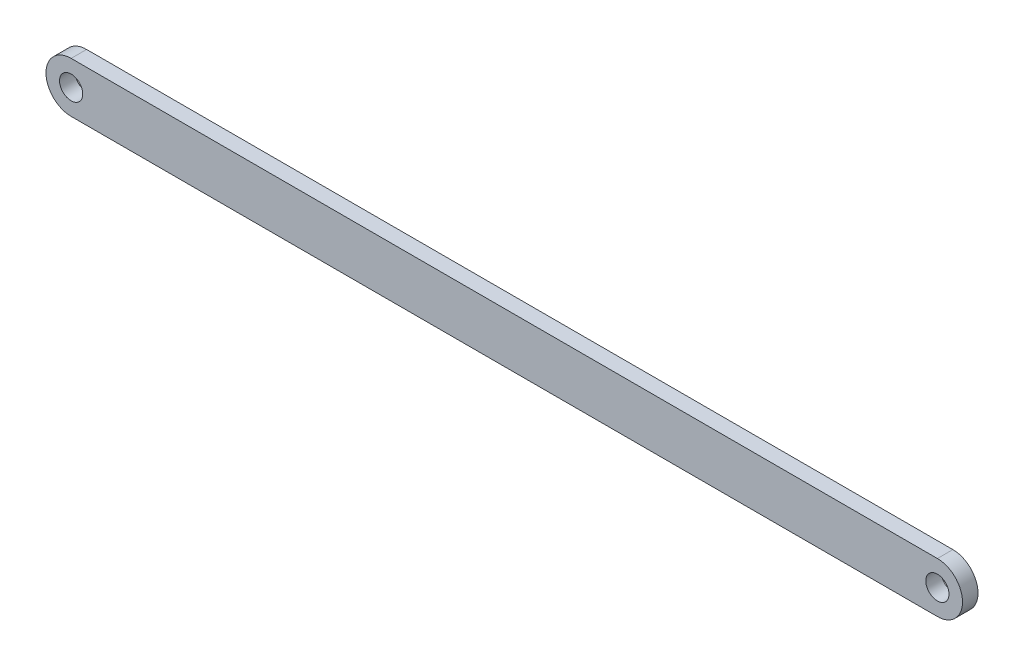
ISO-10303-21;
HEADER;
FILE_DESCRIPTION(('STEP AP214'),'2;1');
FILE_NAME('part.step','',(''),(''),'','','');
FILE_SCHEMA(('AUTOMOTIVE_DESIGN { 1 0 10303 214 1 1 1 1 }'));
ENDSEC;
DATA;
#1=APPLICATION_CONTEXT('core data for automotive mechanical design processes');
#2=APPLICATION_PROTOCOL_DEFINITION('international standard','automotive_design',2000,#1);
#3=PRODUCT_CONTEXT('',#1,'mechanical');
#4=PRODUCT('Part','Part','',(#3));
#5=PRODUCT_RELATED_PRODUCT_CATEGORY('part','',(#4));
#6=PRODUCT_DEFINITION_FORMATION('','',#4);
#7=PRODUCT_DEFINITION_CONTEXT('part definition',#1,'design');
#8=PRODUCT_DEFINITION('design','',#6,#7);
#9=PRODUCT_DEFINITION_SHAPE('','',#8);
#10=(LENGTH_UNIT() NAMED_UNIT(*) SI_UNIT(.MILLI.,.METRE.));
#11=(NAMED_UNIT(*) PLANE_ANGLE_UNIT() SI_UNIT($,.RADIAN.));
#12=(NAMED_UNIT(*) SI_UNIT($,.STERADIAN.) SOLID_ANGLE_UNIT());
#13=UNCERTAINTY_MEASURE_WITH_UNIT(LENGTH_MEASURE(1.E-05),#10,'distance_accuracy_value','');
#14=(GEOMETRIC_REPRESENTATION_CONTEXT(3) GLOBAL_UNCERTAINTY_ASSIGNED_CONTEXT((#13)) GLOBAL_UNIT_ASSIGNED_CONTEXT((#10,
#11,#12)) REPRESENTATION_CONTEXT('',''));
#15=CARTESIAN_POINT('',(0.,0.,0.));
#16=DIRECTION('',(0.,0.,1.));
#17=DIRECTION('',(1.,0.,0.));
#18=AXIS2_PLACEMENT_3D('',#15,#16,#17);
#19=CARTESIAN_POINT('',(0.,0.,12.7));
#20=DIRECTION('',(0.,0.,-1.));
#21=DIRECTION('',(-1.,0.,0.));
#22=AXIS2_PLACEMENT_3D('',#19,#20,#21);
#23=PLANE('',#22);
#24=CARTESIAN_POINT('',(0.,0.,12.7));
#25=DIRECTION('',(0.,0.,1.));
#26=DIRECTION('',(1.,0.,0.));
#27=AXIS2_PLACEMENT_3D('',#24,#25,#26);
#28=CIRCLE('',#27,9.525);
#29=CARTESIAN_POINT('',(9.525,0.,12.7));
#30=VERTEX_POINT('',#29);
#31=EDGE_CURVE('E98',#30,#30,#28,.T.);
#32=ORIENTED_EDGE('',*,*,#31,.F.);
#33=EDGE_LOOP('',(#32));
#34=FACE_BOUND('',#33,.T.);
#35=CARTESIAN_POINT('',(0.,0.,12.7));
#36=DIRECTION('',(0.,0.,1.));
#37=DIRECTION('',(-1.,0.,0.));
#38=AXIS2_PLACEMENT_3D('',#35,#36,#37);
#39=CIRCLE('',#38,20.6375);
#40=CARTESIAN_POINT('',(0.,20.6375,12.7));
#41=VERTEX_POINT('',#40);
#42=CARTESIAN_POINT('',(0.,-20.6375000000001,12.7));
#43=VERTEX_POINT('',#42);
#44=EDGE_CURVE('E83',#41,#43,#39,.T.);
#45=ORIENTED_EDGE('',*,*,#44,.T.);
#46=DIRECTION('',(1.,0.,0.));
#47=VECTOR('',#46,1.);
#48=CARTESIAN_POINT('',(711.2,-20.6375,12.7));
#49=LINE('',#48,#47);
#50=CARTESIAN_POINT('',(711.2,-20.6375,12.7));
#51=VERTEX_POINT('',#50);
#52=EDGE_CURVE('E78',#43,#51,#49,.T.);
#53=ORIENTED_EDGE('',*,*,#52,.T.);
#54=CARTESIAN_POINT('',(711.2,0.,12.7));
#55=DIRECTION('',(0.,0.,1.));
#56=DIRECTION('',(-1.,0.,0.));
#57=AXIS2_PLACEMENT_3D('',#54,#55,#56);
#58=CIRCLE('',#57,20.6375);
#59=CARTESIAN_POINT('',(711.2,20.6375,12.7));
#60=VERTEX_POINT('',#59);
#61=EDGE_CURVE('E81',#51,#60,#58,.T.);
#62=ORIENTED_EDGE('',*,*,#61,.T.);
#63=DIRECTION('',(-1.,0.,0.));
#64=VECTOR('',#63,1.);
#65=CARTESIAN_POINT('',(0.,20.6375,12.7));
#66=LINE('',#65,#64);
#67=EDGE_CURVE('E48',#60,#41,#66,.T.);
#68=ORIENTED_EDGE('',*,*,#67,.T.);
#69=EDGE_LOOP('',(#45,#53,#62,#68));
#70=FACE_BOUND('',#69,.T.);
#71=CARTESIAN_POINT('',(711.2,0.,12.7));
#72=DIRECTION('',(0.,0.,1.));
#73=DIRECTION('',(1.,0.,0.));
#74=AXIS2_PLACEMENT_3D('',#71,#72,#73);
#75=CIRCLE('',#74,9.52500000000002);
#76=CARTESIAN_POINT('',(720.725,0.,12.7));
#77=VERTEX_POINT('',#76);
#78=EDGE_CURVE('E113',#77,#77,#75,.T.);
#79=ORIENTED_EDGE('',*,*,#78,.F.);
#80=EDGE_LOOP('',(#79));
#81=FACE_BOUND('',#80,.T.);
#82=ADVANCED_FACE('F31',(#34,#70,#81),#23,.F.);
#83=CARTESIAN_POINT('',(0.,0.,0.));
#84=DIRECTION('',(0.,0.,-1.));
#85=DIRECTION('',(-1.,0.,0.));
#86=AXIS2_PLACEMENT_3D('',#83,#84,#85);
#87=PLANE('',#86);
#88=CARTESIAN_POINT('',(0.,0.,0.));
#89=DIRECTION('',(0.,0.,1.));
#90=DIRECTION('',(1.,0.,0.));
#91=AXIS2_PLACEMENT_3D('',#88,#89,#90);
#92=CIRCLE('',#91,9.525);
#93=CARTESIAN_POINT('',(9.525,0.,0.));
#94=VERTEX_POINT('',#93);
#95=EDGE_CURVE('E110',#94,#94,#92,.T.);
#96=ORIENTED_EDGE('',*,*,#95,.T.);
#97=EDGE_LOOP('',(#96));
#98=FACE_BOUND('',#97,.T.);
#99=CARTESIAN_POINT('',(0.,0.,0.));
#100=DIRECTION('',(0.,0.,1.));
#101=DIRECTION('',(-1.,0.,0.));
#102=AXIS2_PLACEMENT_3D('',#99,#100,#101);
#103=CIRCLE('',#102,20.6375);
#104=CARTESIAN_POINT('',(0.,20.6375,0.));
#105=VERTEX_POINT('',#104);
#106=CARTESIAN_POINT('',(0.,-20.6375000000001,0.));
#107=VERTEX_POINT('',#106);
#108=EDGE_CURVE('E95',#105,#107,#103,.T.);
#109=ORIENTED_EDGE('',*,*,#108,.F.);
#110=DIRECTION('',(-1.,0.,0.));
#111=VECTOR('',#110,1.);
#112=CARTESIAN_POINT('',(0.,20.6375,0.));
#113=LINE('',#112,#111);
#114=CARTESIAN_POINT('',(711.2,20.6375,0.));
#115=VERTEX_POINT('',#114);
#116=EDGE_CURVE('E71',#115,#105,#113,.T.);
#117=ORIENTED_EDGE('',*,*,#116,.F.);
#118=CARTESIAN_POINT('',(711.2,0.,0.));
#119=DIRECTION('',(0.,0.,1.));
#120=DIRECTION('',(-1.,0.,0.));
#121=AXIS2_PLACEMENT_3D('',#118,#119,#120);
#122=CIRCLE('',#121,20.6375);
#123=CARTESIAN_POINT('',(711.2,-20.6375,0.));
#124=VERTEX_POINT('',#123);
#125=EDGE_CURVE('E65',#124,#115,#122,.T.);
#126=ORIENTED_EDGE('',*,*,#125,.F.);
#127=DIRECTION('',(1.,0.,0.));
#128=VECTOR('',#127,1.);
#129=CARTESIAN_POINT('',(711.2,-20.6375,0.));
#130=LINE('',#129,#128);
#131=EDGE_CURVE('E87',#107,#124,#130,.T.);
#132=ORIENTED_EDGE('',*,*,#131,.F.);
#133=EDGE_LOOP('',(#109,#117,#126,#132));
#134=FACE_BOUND('',#133,.T.);
#135=CARTESIAN_POINT('',(711.2,0.,0.));
#136=DIRECTION('',(0.,0.,1.));
#137=DIRECTION('',(1.,0.,0.));
#138=AXIS2_PLACEMENT_3D('',#135,#136,#137);
#139=CIRCLE('',#138,9.52500000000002);
#140=CARTESIAN_POINT('',(720.725,0.,0.));
#141=VERTEX_POINT('',#140);
#142=EDGE_CURVE('E116',#141,#141,#139,.T.);
#143=ORIENTED_EDGE('',*,*,#142,.T.);
#144=EDGE_LOOP('',(#143));
#145=FACE_BOUND('',#144,.T.);
#146=ADVANCED_FACE('F106',(#98,#134,#145),#87,.T.);
#147=CARTESIAN_POINT('',(0.,0.,12.7));
#148=DIRECTION('',(0.,0.,-1.));
#149=DIRECTION('',(-1.,0.,0.));
#150=AXIS2_PLACEMENT_3D('',#147,#148,#149);
#151=CYLINDRICAL_SURFACE('',#150,20.6375);
#152=ORIENTED_EDGE('',*,*,#108,.T.);
#153=DIRECTION('',(0.,0.,-1.));
#154=VECTOR('',#153,1.);
#155=CARTESIAN_POINT('',(0.,-20.6375000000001,12.7));
#156=LINE('',#155,#154);
#157=EDGE_CURVE('E11',#43,#107,#156,.T.);
#158=ORIENTED_EDGE('',*,*,#157,.F.);
#159=ORIENTED_EDGE('',*,*,#44,.F.);
#160=DIRECTION('',(0.,0.,-1.));
#161=VECTOR('',#160,1.);
#162=CARTESIAN_POINT('',(0.,20.6375,12.7));
#163=LINE('',#162,#161);
#164=EDGE_CURVE('E91',#41,#105,#163,.T.);
#165=ORIENTED_EDGE('',*,*,#164,.T.);
#166=EDGE_LOOP('',(#152,#158,#159,#165));
#167=FACE_BOUND('',#166,.T.);
#168=ADVANCED_FACE('F33',(#167),#151,.T.);
#169=CARTESIAN_POINT('',(711.2,-20.6375,12.7));
#170=DIRECTION('',(0.,1.,0.));
#171=DIRECTION('',(-1.,0.,0.));
#172=AXIS2_PLACEMENT_3D('',#169,#170,#171);
#173=PLANE('',#172);
#174=ORIENTED_EDGE('',*,*,#131,.T.);
#175=DIRECTION('',(0.,0.,-1.));
#176=VECTOR('',#175,1.);
#177=CARTESIAN_POINT('',(711.2,-20.6375,12.7));
#178=LINE('',#177,#176);
#179=EDGE_CURVE('E40',#51,#124,#178,.T.);
#180=ORIENTED_EDGE('',*,*,#179,.F.);
#181=ORIENTED_EDGE('',*,*,#52,.F.);
#182=ORIENTED_EDGE('',*,*,#157,.T.);
#183=EDGE_LOOP('',(#174,#180,#181,#182));
#184=FACE_BOUND('',#183,.T.);
#185=ADVANCED_FACE('F86',(#184),#173,.F.);
#186=CARTESIAN_POINT('',(711.2,0.,12.7));
#187=DIRECTION('',(0.,0.,-1.));
#188=DIRECTION('',(-1.,0.,0.));
#189=AXIS2_PLACEMENT_3D('',#186,#187,#188);
#190=CYLINDRICAL_SURFACE('',#189,20.6375);
#191=ORIENTED_EDGE('',*,*,#125,.T.);
#192=DIRECTION('',(0.,0.,-1.));
#193=VECTOR('',#192,1.);
#194=CARTESIAN_POINT('',(711.2,20.6375,12.7));
#195=LINE('',#194,#193);
#196=EDGE_CURVE('E88',#60,#115,#195,.T.);
#197=ORIENTED_EDGE('',*,*,#196,.F.);
#198=ORIENTED_EDGE('',*,*,#61,.F.);
#199=ORIENTED_EDGE('',*,*,#179,.T.);
#200=EDGE_LOOP('',(#191,#197,#198,#199));
#201=FACE_BOUND('',#200,.T.);
#202=ADVANCED_FACE('F89',(#201),#190,.T.);
#203=CARTESIAN_POINT('',(0.,20.6375,12.7));
#204=DIRECTION('',(0.,-1.,0.));
#205=DIRECTION('',(0.,0.,-1.));
#206=AXIS2_PLACEMENT_3D('',#203,#204,#205);
#207=PLANE('',#206);
#208=ORIENTED_EDGE('',*,*,#116,.T.);
#209=ORIENTED_EDGE('',*,*,#164,.F.);
#210=ORIENTED_EDGE('',*,*,#67,.F.);
#211=ORIENTED_EDGE('',*,*,#196,.T.);
#212=EDGE_LOOP('',(#208,#209,#210,#211));
#213=FACE_BOUND('',#212,.T.);
#214=ADVANCED_FACE('F103',(#213),#207,.F.);
#215=CARTESIAN_POINT('',(0.,0.,12.7));
#216=DIRECTION('',(0.,0.,-1.));
#217=DIRECTION('',(-1.,0.,0.));
#218=AXIS2_PLACEMENT_3D('',#215,#216,#217);
#219=CYLINDRICAL_SURFACE('',#218,9.525);
#220=ORIENTED_EDGE('',*,*,#31,.T.);
#221=EDGE_LOOP('',(#220));
#222=FACE_BOUND('',#221,.T.);
#223=ORIENTED_EDGE('',*,*,#95,.F.);
#224=EDGE_LOOP('',(#223));
#225=FACE_BOUND('',#224,.T.);
#226=ADVANCED_FACE('F134',(#222,#225),#219,.F.);
#227=CARTESIAN_POINT('',(711.2,0.,12.7));
#228=DIRECTION('',(0.,0.,-1.));
#229=DIRECTION('',(-1.,0.,0.));
#230=AXIS2_PLACEMENT_3D('',#227,#228,#229);
#231=CYLINDRICAL_SURFACE('',#230,9.52500000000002);
#232=ORIENTED_EDGE('',*,*,#78,.T.);
#233=EDGE_LOOP('',(#232));
#234=FACE_BOUND('',#233,.T.);
#235=ORIENTED_EDGE('',*,*,#142,.F.);
#236=EDGE_LOOP('',(#235));
#237=FACE_BOUND('',#236,.T.);
#238=ADVANCED_FACE('F122',(#234,#237),#231,.F.);
#239=CLOSED_SHELL('',(#82,#146,#168,#185,#202,#214,#226,#238));
#240=MANIFOLD_SOLID_BREP('B2',#239);
#241=ADVANCED_BREP_SHAPE_REPRESENTATION('',(#18,#240),#14);
#242=SHAPE_DEFINITION_REPRESENTATION(#9,#241);
ENDSEC;
END-ISO-10303-21;
